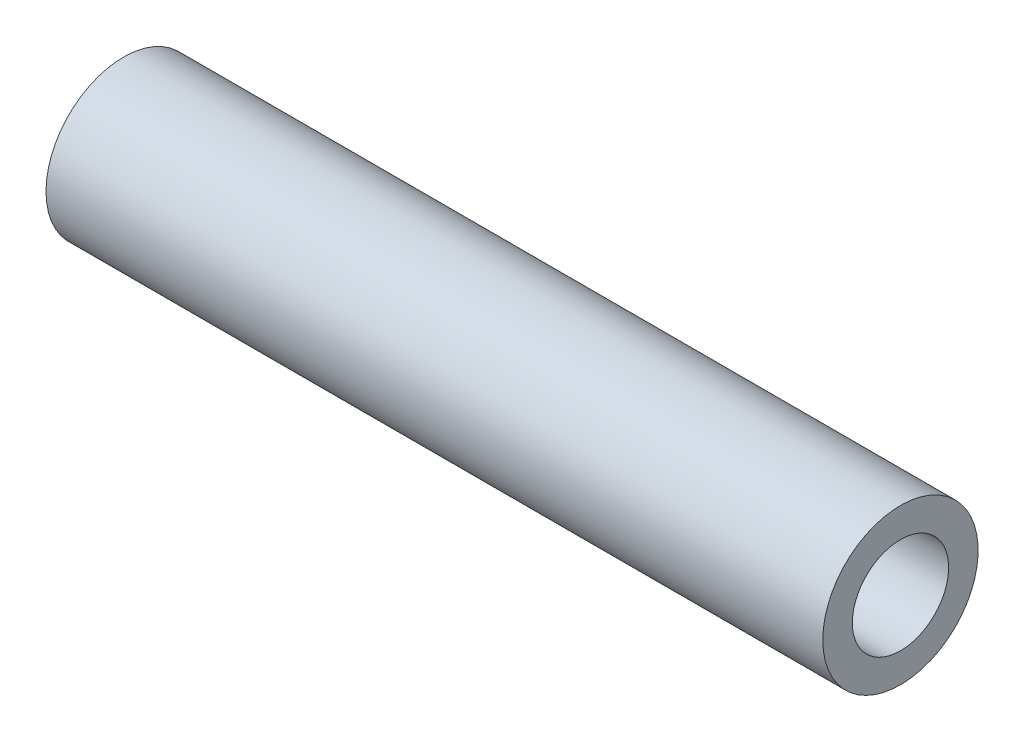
ISO-10303-21;
HEADER;
FILE_DESCRIPTION(('STEP AP214'),'2;1');
FILE_NAME('part.step','',(''),(''),'','','');
FILE_SCHEMA(('AUTOMOTIVE_DESIGN { 1 0 10303 214 1 1 1 1 }'));
ENDSEC;
DATA;
#1=APPLICATION_CONTEXT('core data for automotive mechanical design processes');
#2=APPLICATION_PROTOCOL_DEFINITION('international standard','automotive_design',2000,#1);
#3=PRODUCT_CONTEXT('',#1,'mechanical');
#4=PRODUCT('Part','Part','',(#3));
#5=PRODUCT_RELATED_PRODUCT_CATEGORY('part','',(#4));
#6=PRODUCT_DEFINITION_FORMATION('','',#4);
#7=PRODUCT_DEFINITION_CONTEXT('part definition',#1,'design');
#8=PRODUCT_DEFINITION('design','',#6,#7);
#9=PRODUCT_DEFINITION_SHAPE('','',#8);
#10=(LENGTH_UNIT() NAMED_UNIT(*) SI_UNIT(.MILLI.,.METRE.));
#11=(NAMED_UNIT(*) PLANE_ANGLE_UNIT() SI_UNIT($,.RADIAN.));
#12=(NAMED_UNIT(*) SI_UNIT($,.STERADIAN.) SOLID_ANGLE_UNIT());
#13=UNCERTAINTY_MEASURE_WITH_UNIT(LENGTH_MEASURE(1.E-05),#10,'distance_accuracy_value','');
#14=(GEOMETRIC_REPRESENTATION_CONTEXT(3) GLOBAL_UNCERTAINTY_ASSIGNED_CONTEXT((#13)) GLOBAL_UNIT_ASSIGNED_CONTEXT((#10,
#11,#12)) REPRESENTATION_CONTEXT('',''));
#15=CARTESIAN_POINT('',(0.,0.,0.));
#16=DIRECTION('',(0.,0.,1.));
#17=DIRECTION('',(1.,0.,0.));
#18=AXIS2_PLACEMENT_3D('',#15,#16,#17);
#19=CARTESIAN_POINT('',(-47.4,15.75,-30.5));
#20=DIRECTION('',(-1.,0.,0.));
#21=DIRECTION('',(0.,0.,1.));
#22=AXIS2_PLACEMENT_3D('',#19,#20,#21);
#23=PLANE('',#22);
#24=CARTESIAN_POINT('',(-47.4,15.75,-30.5));
#25=DIRECTION('',(-1.,0.,0.));
#26=DIRECTION('',(0.,0.,1.));
#27=AXIS2_PLACEMENT_3D('',#24,#25,#26);
#28=CIRCLE('',#27,5.);
#29=CARTESIAN_POINT('',(-47.4,15.75,-25.5));
#30=VERTEX_POINT('',#29);
#31=EDGE_CURVE('E8',#30,#30,#28,.T.);
#32=ORIENTED_EDGE('',*,*,#31,.T.);
#33=EDGE_LOOP('',(#32));
#34=FACE_BOUND('',#33,.T.);
#35=CARTESIAN_POINT('',(-47.4,15.75,-30.5));
#36=DIRECTION('',(1.,0.,0.));
#37=DIRECTION('',(0.,0.,1.));
#38=AXIS2_PLACEMENT_3D('',#35,#36,#37);
#39=CIRCLE('',#38,3.1);
#40=CARTESIAN_POINT('',(-47.4,15.75,-27.4));
#41=VERTEX_POINT('',#40);
#42=EDGE_CURVE('E16',#41,#41,#39,.T.);
#43=ORIENTED_EDGE('',*,*,#42,.T.);
#44=EDGE_LOOP('',(#43));
#45=FACE_BOUND('',#44,.T.);
#46=ADVANCED_FACE('F12',(#34,#45),#23,.T.);
#47=CARTESIAN_POINT('',(2.59999999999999,15.75,-30.5));
#48=DIRECTION('',(1.,0.,0.));
#49=DIRECTION('',(0.,0.,-1.));
#50=AXIS2_PLACEMENT_3D('',#47,#48,#49);
#51=PLANE('',#50);
#52=CARTESIAN_POINT('',(2.59999999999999,15.75,-30.5));
#53=DIRECTION('',(1.,0.,0.));
#54=DIRECTION('',(0.,0.,1.));
#55=AXIS2_PLACEMENT_3D('',#52,#53,#54);
#56=CIRCLE('',#55,5.);
#57=CARTESIAN_POINT('',(2.59999999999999,15.75,-25.5));
#58=VERTEX_POINT('',#57);
#59=EDGE_CURVE('E28',#58,#58,#56,.T.);
#60=ORIENTED_EDGE('',*,*,#59,.T.);
#61=EDGE_LOOP('',(#60));
#62=FACE_BOUND('',#61,.T.);
#63=CARTESIAN_POINT('',(2.59999999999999,15.75,-30.5));
#64=DIRECTION('',(-1.,0.,0.));
#65=DIRECTION('',(0.,0.,1.));
#66=AXIS2_PLACEMENT_3D('',#63,#64,#65);
#67=CIRCLE('',#66,3.1);
#68=CARTESIAN_POINT('',(2.59999999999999,15.75,-27.4));
#69=VERTEX_POINT('',#68);
#70=EDGE_CURVE('E30',#69,#69,#67,.T.);
#71=ORIENTED_EDGE('',*,*,#70,.T.);
#72=EDGE_LOOP('',(#71));
#73=FACE_BOUND('',#72,.T.);
#74=ADVANCED_FACE('F38',(#62,#73),#51,.T.);
#75=CARTESIAN_POINT('',(-22.4,15.75,-30.5));
#76=DIRECTION('',(1.,0.,0.));
#77=DIRECTION('',(0.,0.,-1.));
#78=AXIS2_PLACEMENT_3D('',#75,#76,#77);
#79=CYLINDRICAL_SURFACE('',#78,5.);
#80=ORIENTED_EDGE('',*,*,#59,.F.);
#81=EDGE_LOOP('',(#80));
#82=FACE_BOUND('',#81,.T.);
#83=ORIENTED_EDGE('',*,*,#31,.F.);
#84=EDGE_LOOP('',(#83));
#85=FACE_BOUND('',#84,.T.);
#86=ADVANCED_FACE('F41',(#82,#85),#79,.T.);
#87=CARTESIAN_POINT('',(-22.4,15.75,-30.5));
#88=DIRECTION('',(1.,0.,0.));
#89=DIRECTION('',(0.,0.,-1.));
#90=AXIS2_PLACEMENT_3D('',#87,#88,#89);
#91=CYLINDRICAL_SURFACE('',#90,3.1);
#92=ORIENTED_EDGE('',*,*,#42,.F.);
#93=EDGE_LOOP('',(#92));
#94=FACE_BOUND('',#93,.T.);
#95=ORIENTED_EDGE('',*,*,#70,.F.);
#96=EDGE_LOOP('',(#95));
#97=FACE_BOUND('',#96,.T.);
#98=ADVANCED_FACE('F14',(#94,#97),#91,.F.);
#99=CLOSED_SHELL('',(#46,#74,#86,#98));
#100=MANIFOLD_SOLID_BREP('B1',#99);
#101=ADVANCED_BREP_SHAPE_REPRESENTATION('',(#18,#100),#14);
#102=SHAPE_DEFINITION_REPRESENTATION(#9,#101);
ENDSEC;
END-ISO-10303-21;
